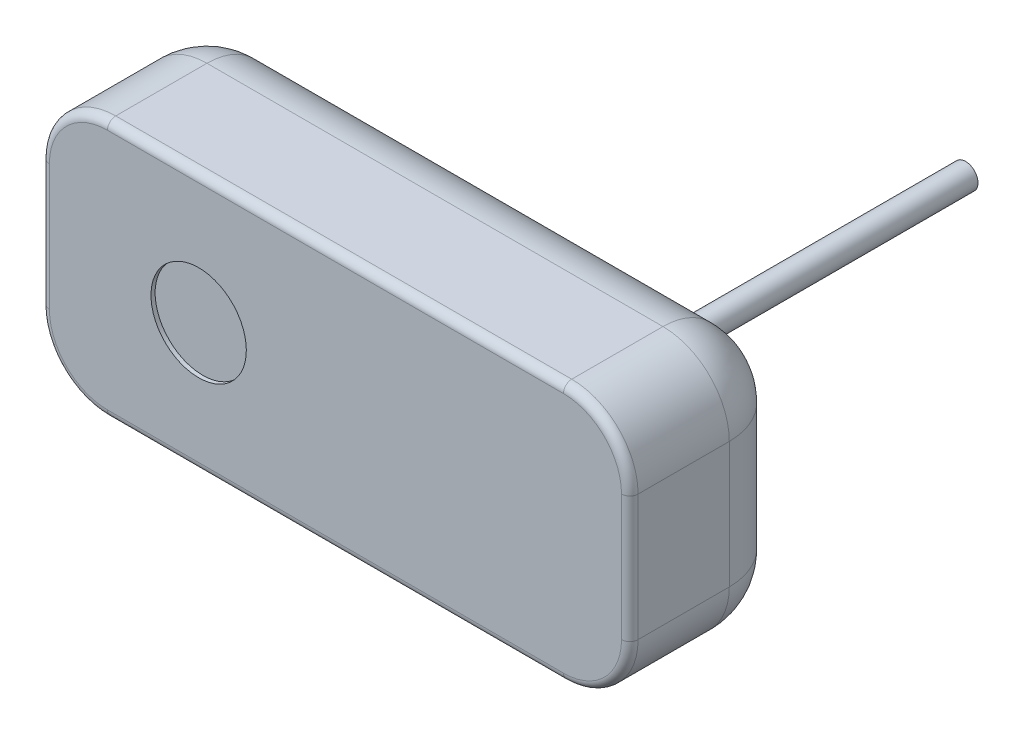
ISO-10303-21;
HEADER;
FILE_DESCRIPTION(('STEP AP214'),'2;1');
FILE_NAME('part.step','',(''),(''),'','','');
FILE_SCHEMA(('AUTOMOTIVE_DESIGN { 1 0 10303 214 1 1 1 1 }'));
ENDSEC;
DATA;
#1=APPLICATION_CONTEXT('core data for automotive mechanical design processes');
#2=APPLICATION_PROTOCOL_DEFINITION('international standard','automotive_design',2000,#1);
#3=PRODUCT_CONTEXT('',#1,'mechanical');
#4=PRODUCT('Part','Part','',(#3));
#5=PRODUCT_RELATED_PRODUCT_CATEGORY('part','',(#4));
#6=PRODUCT_DEFINITION_FORMATION('','',#4);
#7=PRODUCT_DEFINITION_CONTEXT('part definition',#1,'design');
#8=PRODUCT_DEFINITION('design','',#6,#7);
#9=PRODUCT_DEFINITION_SHAPE('','',#8);
#10=(LENGTH_UNIT() NAMED_UNIT(*) SI_UNIT(.MILLI.,.METRE.));
#11=(NAMED_UNIT(*) PLANE_ANGLE_UNIT() SI_UNIT($,.RADIAN.));
#12=(NAMED_UNIT(*) SI_UNIT($,.STERADIAN.) SOLID_ANGLE_UNIT());
#13=UNCERTAINTY_MEASURE_WITH_UNIT(LENGTH_MEASURE(1.E-05),#10,'distance_accuracy_value','');
#14=(GEOMETRIC_REPRESENTATION_CONTEXT(3) GLOBAL_UNCERTAINTY_ASSIGNED_CONTEXT((#13)) GLOBAL_UNIT_ASSIGNED_CONTEXT((#10,
#11,#12)) REPRESENTATION_CONTEXT('',''));
#15=CARTESIAN_POINT('',(0.,0.,0.));
#16=DIRECTION('',(0.,0.,1.));
#17=DIRECTION('',(1.,0.,0.));
#18=AXIS2_PLACEMENT_3D('',#15,#16,#17);
#19=CARTESIAN_POINT('',(-35.5,-15.6,20.));
#20=DIRECTION('',(-1.,0.,0.));
#21=DIRECTION('',(0.,0.,1.));
#22=AXIS2_PLACEMENT_3D('',#19,#20,#21);
#23=PLANE('',#22);
#24=DIRECTION('',(0.,0.,-1.));
#25=VECTOR('',#24,1.);
#26=CARTESIAN_POINT('',(-35.5,-7.6,20.));
#27=LINE('',#26,#25);
#28=CARTESIAN_POINT('',(-35.5,-7.6,8.));
#29=VERTEX_POINT('',#28);
#30=CARTESIAN_POINT('',(-35.5,-7.6,19.));
#31=VERTEX_POINT('',#30);
#32=EDGE_CURVE('E445',#29,#31,#27,.F.);
#33=ORIENTED_EDGE('',*,*,#32,.T.);
#34=DIRECTION('',(0.,1.,0.));
#35=VECTOR('',#34,1.);
#36=CARTESIAN_POINT('',(-35.5,7.6,19.));
#37=LINE('',#36,#35);
#38=CARTESIAN_POINT('',(-35.5,7.6,19.));
#39=VERTEX_POINT('',#38);
#40=EDGE_CURVE('E375',#31,#39,#37,.T.);
#41=ORIENTED_EDGE('',*,*,#40,.T.);
#42=DIRECTION('',(0.,0.,-1.));
#43=VECTOR('',#42,1.);
#44=CARTESIAN_POINT('',(-35.5,7.6,20.));
#45=LINE('',#44,#43);
#46=CARTESIAN_POINT('',(-35.5,7.6,8.));
#47=VERTEX_POINT('',#46);
#48=EDGE_CURVE('E448',#39,#47,#45,.T.);
#49=ORIENTED_EDGE('',*,*,#48,.T.);
#50=DIRECTION('',(0.,1.,0.));
#51=VECTOR('',#50,1.);
#52=CARTESIAN_POINT('',(-35.5,-15.6,8.));
#53=LINE('',#52,#51);
#54=EDGE_CURVE('E430',#47,#29,#53,.F.);
#55=ORIENTED_EDGE('',*,*,#54,.T.);
#56=EDGE_LOOP('',(#33,#41,#49,#55));
#57=FACE_BOUND('',#56,.T.);
#58=ADVANCED_FACE('F37',(#57),#23,.T.);
#59=CARTESIAN_POINT('',(-35.5,-15.6,20.));
#60=DIRECTION('',(0.,1.,0.));
#61=DIRECTION('',(0.,0.,1.));
#62=AXIS2_PLACEMENT_3D('',#59,#60,#61);
#63=PLANE('',#62);
#64=DIRECTION('',(0.,0.,-1.));
#65=VECTOR('',#64,1.);
#66=CARTESIAN_POINT('',(27.5,-15.6,20.));
#67=LINE('',#66,#65);
#68=CARTESIAN_POINT('',(27.5,-15.6,8.));
#69=VERTEX_POINT('',#68);
#70=CARTESIAN_POINT('',(27.5,-15.6,19.));
#71=VERTEX_POINT('',#70);
#72=EDGE_CURVE('E450',#69,#71,#67,.F.);
#73=ORIENTED_EDGE('',*,*,#72,.T.);
#74=DIRECTION('',(1.,0.,0.));
#75=VECTOR('',#74,1.);
#76=CARTESIAN_POINT('',(-35.5,-15.6,19.));
#77=LINE('',#76,#75);
#78=CARTESIAN_POINT('',(-27.5,-15.6,19.));
#79=VERTEX_POINT('',#78);
#80=EDGE_CURVE('E371',#71,#79,#77,.F.);
#81=ORIENTED_EDGE('',*,*,#80,.T.);
#82=DIRECTION('',(0.,0.,-1.));
#83=VECTOR('',#82,1.);
#84=CARTESIAN_POINT('',(-27.5,-15.6,0.));
#85=LINE('',#84,#83);
#86=CARTESIAN_POINT('',(-27.5,-15.6,8.));
#87=VERTEX_POINT('',#86);
#88=EDGE_CURVE('E453',#79,#87,#85,.T.);
#89=ORIENTED_EDGE('',*,*,#88,.T.);
#90=DIRECTION('',(1.,0.,0.));
#91=VECTOR('',#90,1.);
#92=CARTESIAN_POINT('',(27.5,-15.6,8.));
#93=LINE('',#92,#91);
#94=EDGE_CURVE('E425',#87,#69,#93,.T.);
#95=ORIENTED_EDGE('',*,*,#94,.T.);
#96=EDGE_LOOP('',(#73,#81,#89,#95));
#97=FACE_BOUND('',#96,.T.);
#98=ADVANCED_FACE('F244',(#97),#63,.F.);
#99=CARTESIAN_POINT('',(35.5,-15.6,20.));
#100=DIRECTION('',(-1.,0.,0.));
#101=DIRECTION('',(0.,0.,1.));
#102=AXIS2_PLACEMENT_3D('',#99,#100,#101);
#103=PLANE('',#102);
#104=DIRECTION('',(0.,0.,-1.));
#105=VECTOR('',#104,1.);
#106=CARTESIAN_POINT('',(35.5,7.6,20.));
#107=LINE('',#106,#105);
#108=CARTESIAN_POINT('',(35.5,7.6,8.));
#109=VERTEX_POINT('',#108);
#110=CARTESIAN_POINT('',(35.5,7.6,19.));
#111=VERTEX_POINT('',#110);
#112=EDGE_CURVE('E400',#109,#111,#107,.F.);
#113=ORIENTED_EDGE('',*,*,#112,.T.);
#114=DIRECTION('',(0.,1.,0.));
#115=VECTOR('',#114,1.);
#116=CARTESIAN_POINT('',(35.5,-15.6,19.));
#117=LINE('',#116,#115);
#118=CARTESIAN_POINT('',(35.5,-7.6,19.));
#119=VERTEX_POINT('',#118);
#120=EDGE_CURVE('E337',#111,#119,#117,.F.);
#121=ORIENTED_EDGE('',*,*,#120,.T.);
#122=DIRECTION('',(0.,0.,-1.));
#123=VECTOR('',#122,1.);
#124=CARTESIAN_POINT('',(35.5,-7.6,20.));
#125=LINE('',#124,#123);
#126=CARTESIAN_POINT('',(35.5,-7.6,8.));
#127=VERTEX_POINT('',#126);
#128=EDGE_CURVE('E455',#119,#127,#125,.T.);
#129=ORIENTED_EDGE('',*,*,#128,.T.);
#130=DIRECTION('',(0.,1.,0.));
#131=VECTOR('',#130,1.);
#132=CARTESIAN_POINT('',(35.5,7.6,8.));
#133=LINE('',#132,#131);
#134=EDGE_CURVE('E420',#127,#109,#133,.T.);
#135=ORIENTED_EDGE('',*,*,#134,.T.);
#136=EDGE_LOOP('',(#113,#121,#129,#135));
#137=FACE_BOUND('',#136,.T.);
#138=ADVANCED_FACE('F247',(#137),#103,.F.);
#139=CARTESIAN_POINT('',(-35.5,15.6,20.));
#140=DIRECTION('',(0.,1.,0.));
#141=DIRECTION('',(0.,0.,1.));
#142=AXIS2_PLACEMENT_3D('',#139,#140,#141);
#143=PLANE('',#142);
#144=DIRECTION('',(0.,0.,-1.));
#145=VECTOR('',#144,1.);
#146=CARTESIAN_POINT('',(-27.5,15.6,20.));
#147=LINE('',#146,#145);
#148=CARTESIAN_POINT('',(-27.5,15.6,8.));
#149=VERTEX_POINT('',#148);
#150=CARTESIAN_POINT('',(-27.5,15.6,19.));
#151=VERTEX_POINT('',#150);
#152=EDGE_CURVE('E442',#149,#151,#147,.F.);
#153=ORIENTED_EDGE('',*,*,#152,.T.);
#154=DIRECTION('',(1.,0.,0.));
#155=VECTOR('',#154,1.);
#156=CARTESIAN_POINT('',(27.5,15.6,19.));
#157=LINE('',#156,#155);
#158=CARTESIAN_POINT('',(27.5,15.6,19.));
#159=VERTEX_POINT('',#158);
#160=EDGE_CURVE('E11',#151,#159,#157,.T.);
#161=ORIENTED_EDGE('',*,*,#160,.T.);
#162=DIRECTION('',(0.,0.,-1.));
#163=VECTOR('',#162,1.);
#164=CARTESIAN_POINT('',(27.5,15.6,0.));
#165=LINE('',#164,#163);
#166=CARTESIAN_POINT('',(27.5,15.6,8.));
#167=VERTEX_POINT('',#166);
#168=EDGE_CURVE('E440',#159,#167,#165,.T.);
#169=ORIENTED_EDGE('',*,*,#168,.T.);
#170=DIRECTION('',(1.,0.,0.));
#171=VECTOR('',#170,1.);
#172=CARTESIAN_POINT('',(-35.5,15.6,8.));
#173=LINE('',#172,#171);
#174=EDGE_CURVE('E396',#167,#149,#173,.F.);
#175=ORIENTED_EDGE('',*,*,#174,.T.);
#176=EDGE_LOOP('',(#153,#161,#169,#175));
#177=FACE_BOUND('',#176,.T.);
#178=ADVANCED_FACE('F239',(#177),#143,.T.);
#179=CARTESIAN_POINT('',(0.,0.,20.));
#180=DIRECTION('',(0.,0.,-1.));
#181=DIRECTION('',(-1.,0.,0.));
#182=AXIS2_PLACEMENT_3D('',#179,#180,#181);
#183=PLANE('',#182);
#184=CARTESIAN_POINT('',(-16.5,0.,20.));
#185=DIRECTION('',(0.,0.,1.));
#186=DIRECTION('',(1.,0.,0.));
#187=AXIS2_PLACEMENT_3D('',#184,#185,#186);
#188=CIRCLE('',#187,5.75);
#189=CARTESIAN_POINT('',(-10.75,0.,20.));
#190=VERTEX_POINT('',#189);
#191=EDGE_CURVE('E459',#190,#190,#188,.T.);
#192=ORIENTED_EDGE('',*,*,#191,.F.);
#193=EDGE_LOOP('',(#192));
#194=FACE_BOUND('',#193,.T.);
#195=DIRECTION('',(1.,0.,0.));
#196=VECTOR('',#195,1.);
#197=CARTESIAN_POINT('',(-27.5,14.6,20.));
#198=LINE('',#197,#196);
#199=CARTESIAN_POINT('',(27.5,14.6,20.));
#200=VERTEX_POINT('',#199);
#201=CARTESIAN_POINT('',(-27.5,14.6,20.));
#202=VERTEX_POINT('',#201);
#203=EDGE_CURVE('E394',#200,#202,#198,.F.);
#204=ORIENTED_EDGE('',*,*,#203,.T.);
#205=CARTESIAN_POINT('',(-27.5,7.6,20.));
#206=DIRECTION('',(0.,0.,-1.));
#207=DIRECTION('',(-1.,0.,0.));
#208=AXIS2_PLACEMENT_3D('',#205,#206,#207);
#209=CIRCLE('',#208,7.);
#210=CARTESIAN_POINT('',(-34.5,7.6,20.));
#211=VERTEX_POINT('',#210);
#212=EDGE_CURVE('E380',#202,#211,#209,.F.);
#213=ORIENTED_EDGE('',*,*,#212,.T.);
#214=DIRECTION('',(0.,1.,0.));
#215=VECTOR('',#214,1.);
#216=CARTESIAN_POINT('',(-34.5,-7.6,20.));
#217=LINE('',#216,#215);
#218=CARTESIAN_POINT('',(-34.5,-7.6,20.));
#219=VERTEX_POINT('',#218);
#220=EDGE_CURVE('E383',#211,#219,#217,.F.);
#221=ORIENTED_EDGE('',*,*,#220,.T.);
#222=CARTESIAN_POINT('',(-27.5,-7.6,20.));
#223=DIRECTION('',(0.,0.,-1.));
#224=DIRECTION('',(-1.,0.,0.));
#225=AXIS2_PLACEMENT_3D('',#222,#223,#224);
#226=CIRCLE('',#225,7.);
#227=CARTESIAN_POINT('',(-27.5,-14.6,20.));
#228=VERTEX_POINT('',#227);
#229=EDGE_CURVE('E385',#219,#228,#226,.F.);
#230=ORIENTED_EDGE('',*,*,#229,.T.);
#231=DIRECTION('',(1.,0.,0.));
#232=VECTOR('',#231,1.);
#233=CARTESIAN_POINT('',(0.,-14.6,20.));
#234=LINE('',#233,#232);
#235=CARTESIAN_POINT('',(27.5,-14.6,20.));
#236=VERTEX_POINT('',#235);
#237=EDGE_CURVE('E387',#228,#236,#234,.T.);
#238=ORIENTED_EDGE('',*,*,#237,.T.);
#239=CARTESIAN_POINT('',(27.5,-7.6,20.));
#240=DIRECTION('',(0.,0.,-1.));
#241=DIRECTION('',(-1.,0.,0.));
#242=AXIS2_PLACEMENT_3D('',#239,#240,#241);
#243=CIRCLE('',#242,7.);
#244=CARTESIAN_POINT('',(34.5,-7.6,20.));
#245=VERTEX_POINT('',#244);
#246=EDGE_CURVE('E389',#236,#245,#243,.F.);
#247=ORIENTED_EDGE('',*,*,#246,.T.);
#248=DIRECTION('',(0.,1.,0.));
#249=VECTOR('',#248,1.);
#250=CARTESIAN_POINT('',(34.5,0.,20.));
#251=LINE('',#250,#249);
#252=CARTESIAN_POINT('',(34.5,7.6,20.));
#253=VERTEX_POINT('',#252);
#254=EDGE_CURVE('E339',#245,#253,#251,.T.);
#255=ORIENTED_EDGE('',*,*,#254,.T.);
#256=CARTESIAN_POINT('',(27.5,7.6,20.));
#257=DIRECTION('',(0.,0.,-1.));
#258=DIRECTION('',(-1.,0.,0.));
#259=AXIS2_PLACEMENT_3D('',#256,#257,#258);
#260=CIRCLE('',#259,7.);
#261=EDGE_CURVE('E392',#253,#200,#260,.F.);
#262=ORIENTED_EDGE('',*,*,#261,.T.);
#263=EDGE_LOOP('',(#204,#213,#221,#230,#238,#247,#255,#262));
#264=FACE_BOUND('',#263,.T.);
#265=ADVANCED_FACE('F236',(#194,#264),#183,.F.);
#266=CARTESIAN_POINT('',(0.,0.,0.));
#267=DIRECTION('',(0.,0.,-1.));
#268=DIRECTION('',(-1.,0.,0.));
#269=AXIS2_PLACEMENT_3D('',#266,#267,#268);
#270=PLANE('',#269);
#271=CARTESIAN_POINT('',(23.,8.6,0.));
#272=DIRECTION('',(0.,0.,-1.));
#273=DIRECTION('',(-1.,0.,0.));
#274=AXIS2_PLACEMENT_3D('',#271,#272,#273);
#275=CIRCLE('',#274,1.5);
#276=CARTESIAN_POINT('',(24.1180339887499,7.6,0.));
#277=VERTEX_POINT('',#276);
#278=CARTESIAN_POINT('',(21.8819660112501,7.6,0.));
#279=VERTEX_POINT('',#278);
#280=EDGE_CURVE('E180',#277,#279,#275,.T.);
#281=ORIENTED_EDGE('',*,*,#280,.F.);
#282=DIRECTION('',(1.,0.,0.));
#283=VECTOR('',#282,1.);
#284=CARTESIAN_POINT('',(0.,7.6,0.));
#285=LINE('',#284,#283);
#286=CARTESIAN_POINT('',(27.5,7.6,0.));
#287=VERTEX_POINT('',#286);
#288=EDGE_CURVE('E168',#277,#287,#285,.T.);
#289=ORIENTED_EDGE('',*,*,#288,.T.);
#290=DIRECTION('',(0.,1.,0.));
#291=VECTOR('',#290,1.);
#292=CARTESIAN_POINT('',(27.5,-7.6,0.));
#293=LINE('',#292,#291);
#294=CARTESIAN_POINT('',(27.5,-7.6,0.));
#295=VERTEX_POINT('',#294);
#296=EDGE_CURVE('E436',#287,#295,#293,.F.);
#297=ORIENTED_EDGE('',*,*,#296,.T.);
#298=DIRECTION('',(1.,0.,0.));
#299=VECTOR('',#298,1.);
#300=CARTESIAN_POINT('',(-27.5,-7.6,0.));
#301=LINE('',#300,#299);
#302=CARTESIAN_POINT('',(-27.5,-7.6,0.));
#303=VERTEX_POINT('',#302);
#304=EDGE_CURVE('E434',#295,#303,#301,.F.);
#305=ORIENTED_EDGE('',*,*,#304,.T.);
#306=DIRECTION('',(0.,1.,0.));
#307=VECTOR('',#306,1.);
#308=CARTESIAN_POINT('',(-27.5,0.,0.));
#309=LINE('',#308,#307);
#310=CARTESIAN_POINT('',(-27.5,7.6,0.));
#311=VERTEX_POINT('',#310);
#312=EDGE_CURVE('E432',#303,#311,#309,.T.);
#313=ORIENTED_EDGE('',*,*,#312,.T.);
#314=EDGE_CURVE('E176',#311,#279,#285,.T.);
#315=ORIENTED_EDGE('',*,*,#314,.T.);
#316=EDGE_LOOP('',(#281,#289,#297,#305,#313,#315));
#317=FACE_BOUND('',#316,.T.);
#318=DIRECTION('',(0.,-1.,0.));
#319=VECTOR('',#318,1.);
#320=CARTESIAN_POINT('',(-6.5,3.,0.));
#321=LINE('',#320,#319);
#322=CARTESIAN_POINT('',(-6.5,3.,0.));
#323=VERTEX_POINT('',#322);
#324=CARTESIAN_POINT('',(-6.5,-3.,0.));
#325=VERTEX_POINT('',#324);
#326=EDGE_CURVE('E202',#323,#325,#321,.T.);
#327=ORIENTED_EDGE('',*,*,#326,.F.);
#328=DIRECTION('',(-1.,0.,0.));
#329=VECTOR('',#328,1.);
#330=CARTESIAN_POINT('',(-6.5,3.,0.));
#331=LINE('',#330,#329);
#332=CARTESIAN_POINT('',(-13.5,3.,0.));
#333=VERTEX_POINT('',#332);
#334=EDGE_CURVE('E471',#323,#333,#331,.T.);
#335=ORIENTED_EDGE('',*,*,#334,.T.);
#336=DIRECTION('',(0.,-1.,0.));
#337=VECTOR('',#336,1.);
#338=CARTESIAN_POINT('',(-13.5,3.,0.));
#339=LINE('',#338,#337);
#340=CARTESIAN_POINT('',(-13.5,-3.,0.));
#341=VERTEX_POINT('',#340);
#342=EDGE_CURVE('E189',#333,#341,#339,.T.);
#343=ORIENTED_EDGE('',*,*,#342,.T.);
#344=DIRECTION('',(-1.,0.,0.));
#345=VECTOR('',#344,1.);
#346=CARTESIAN_POINT('',(-6.5,-3.,0.));
#347=LINE('',#346,#345);
#348=EDGE_CURVE('E62',#325,#341,#347,.T.);
#349=ORIENTED_EDGE('',*,*,#348,.F.);
#350=EDGE_LOOP('',(#327,#335,#343,#349));
#351=FACE_BOUND('',#350,.T.);
#352=ADVANCED_FACE('F181',(#317,#351),#270,.T.);
#353=CARTESIAN_POINT('',(27.5,-7.6,20.));
#354=DIRECTION('',(0.,0.,-1.));
#355=DIRECTION('',(-1.,0.,0.));
#356=AXIS2_PLACEMENT_3D('',#353,#354,#355);
#357=CYLINDRICAL_SURFACE('',#356,8.);
#358=ORIENTED_EDGE('',*,*,#128,.F.);
#359=CARTESIAN_POINT('',(27.5,-7.6,19.));
#360=DIRECTION('',(0.,0.,-1.));
#361=DIRECTION('',(-1.,0.,0.));
#362=AXIS2_PLACEMENT_3D('',#359,#360,#361);
#363=CIRCLE('',#362,8.);
#364=EDGE_CURVE('E369',#119,#71,#363,.T.);
#365=ORIENTED_EDGE('',*,*,#364,.T.);
#366=ORIENTED_EDGE('',*,*,#72,.F.);
#367=CARTESIAN_POINT('',(27.5,-7.6,8.));
#368=DIRECTION('',(0.,0.,-1.));
#369=DIRECTION('',(-1.,0.,0.));
#370=AXIS2_PLACEMENT_3D('',#367,#368,#369);
#371=CIRCLE('',#370,8.);
#372=EDGE_CURVE('E422',#69,#127,#371,.F.);
#373=ORIENTED_EDGE('',*,*,#372,.T.);
#374=EDGE_LOOP('',(#358,#365,#366,#373));
#375=FACE_BOUND('',#374,.T.);
#376=ADVANCED_FACE('F243',(#375),#357,.T.);
#377=CARTESIAN_POINT('',(-27.5,-7.6,20.));
#378=DIRECTION('',(0.,0.,1.));
#379=DIRECTION('',(1.,0.,0.));
#380=AXIS2_PLACEMENT_3D('',#377,#378,#379);
#381=CYLINDRICAL_SURFACE('',#380,8.);
#382=ORIENTED_EDGE('',*,*,#88,.F.);
#383=CARTESIAN_POINT('',(-27.5,-7.6,19.));
#384=DIRECTION('',(0.,0.,-1.));
#385=DIRECTION('',(-1.,0.,0.));
#386=AXIS2_PLACEMENT_3D('',#383,#384,#385);
#387=CIRCLE('',#386,8.);
#388=EDGE_CURVE('E373',#79,#31,#387,.T.);
#389=ORIENTED_EDGE('',*,*,#388,.T.);
#390=ORIENTED_EDGE('',*,*,#32,.F.);
#391=CARTESIAN_POINT('',(-27.5,-7.6,8.));
#392=DIRECTION('',(0.,0.,1.));
#393=DIRECTION('',(1.,0.,0.));
#394=AXIS2_PLACEMENT_3D('',#391,#392,#393);
#395=CIRCLE('',#394,8.);
#396=EDGE_CURVE('E427',#29,#87,#395,.T.);
#397=ORIENTED_EDGE('',*,*,#396,.T.);
#398=EDGE_LOOP('',(#382,#389,#390,#397));
#399=FACE_BOUND('',#398,.T.);
#400=ADVANCED_FACE('F260',(#399),#381,.T.);
#401=CARTESIAN_POINT('',(27.5,7.6,20.));
#402=DIRECTION('',(0.,0.,1.));
#403=DIRECTION('',(1.,0.,0.));
#404=AXIS2_PLACEMENT_3D('',#401,#402,#403);
#405=CYLINDRICAL_SURFACE('',#404,8.);
#406=ORIENTED_EDGE('',*,*,#168,.F.);
#407=CARTESIAN_POINT('',(27.5,7.6,19.));
#408=DIRECTION('',(0.,0.,-1.));
#409=DIRECTION('',(-1.,0.,0.));
#410=AXIS2_PLACEMENT_3D('',#407,#408,#409);
#411=CIRCLE('',#410,8.);
#412=EDGE_CURVE('E46',#159,#111,#411,.T.);
#413=ORIENTED_EDGE('',*,*,#412,.T.);
#414=ORIENTED_EDGE('',*,*,#112,.F.);
#415=CARTESIAN_POINT('',(27.5,7.6,8.));
#416=DIRECTION('',(0.,0.,1.));
#417=DIRECTION('',(1.,0.,0.));
#418=AXIS2_PLACEMENT_3D('',#415,#416,#417);
#419=CIRCLE('',#418,8.);
#420=EDGE_CURVE('E417',#109,#167,#419,.T.);
#421=ORIENTED_EDGE('',*,*,#420,.T.);
#422=EDGE_LOOP('',(#406,#413,#414,#421));
#423=FACE_BOUND('',#422,.T.);
#424=ADVANCED_FACE('F264',(#423),#405,.T.);
#425=CARTESIAN_POINT('',(-27.5,7.6,20.));
#426=DIRECTION('',(0.,0.,-1.));
#427=DIRECTION('',(-1.,0.,0.));
#428=AXIS2_PLACEMENT_3D('',#425,#426,#427);
#429=CYLINDRICAL_SURFACE('',#428,8.);
#430=ORIENTED_EDGE('',*,*,#48,.F.);
#431=CARTESIAN_POINT('',(-27.5,7.6,19.));
#432=DIRECTION('',(0.,0.,-1.));
#433=DIRECTION('',(-1.,0.,0.));
#434=AXIS2_PLACEMENT_3D('',#431,#432,#433);
#435=CIRCLE('',#434,8.);
#436=EDGE_CURVE('E377',#39,#151,#435,.T.);
#437=ORIENTED_EDGE('',*,*,#436,.T.);
#438=ORIENTED_EDGE('',*,*,#152,.F.);
#439=CARTESIAN_POINT('',(-27.5,7.6,8.));
#440=DIRECTION('',(0.,0.,-1.));
#441=DIRECTION('',(-1.,0.,0.));
#442=AXIS2_PLACEMENT_3D('',#439,#440,#441);
#443=CIRCLE('',#442,8.);
#444=EDGE_CURVE('E177',#149,#47,#443,.F.);
#445=ORIENTED_EDGE('',*,*,#444,.T.);
#446=EDGE_LOOP('',(#430,#437,#438,#445));
#447=FACE_BOUND('',#446,.T.);
#448=ADVANCED_FACE('F268',(#447),#429,.T.);
#449=CARTESIAN_POINT('',(27.5,-7.6,8.));
#450=DIRECTION('',(0.,0.,-1.));
#451=DIRECTION('',(-1.,0.,0.));
#452=AXIS2_PLACEMENT_3D('',#449,#450,#451);
#453=SPHERICAL_SURFACE('',#452,8.);
#454=CARTESIAN_POINT('',(27.5,-7.6,8.));
#455=DIRECTION('',(0.,1.,0.));
#456=DIRECTION('',(0.,0.,1.));
#457=AXIS2_PLACEMENT_3D('',#454,#455,#456);
#458=CIRCLE('',#457,8.);
#459=EDGE_CURVE('E401',#127,#295,#458,.T.);
#460=ORIENTED_EDGE('',*,*,#459,.F.);
#461=ORIENTED_EDGE('',*,*,#372,.F.);
#462=CARTESIAN_POINT('',(27.5,-7.6,8.));
#463=DIRECTION('',(-1.,0.,0.));
#464=DIRECTION('',(0.,-1.,0.));
#465=AXIS2_PLACEMENT_3D('',#462,#463,#464);
#466=CIRCLE('',#465,8.);
#467=EDGE_CURVE('E397',#295,#69,#466,.T.);
#468=ORIENTED_EDGE('',*,*,#467,.F.);
#469=EDGE_LOOP('',(#460,#461,#468));
#470=FACE_BOUND('',#469,.T.);
#471=ADVANCED_FACE('F272',(#470),#453,.T.);
#472=CARTESIAN_POINT('',(-35.5,-7.6,8.));
#473=DIRECTION('',(-1.,0.,0.));
#474=DIRECTION('',(0.,0.,1.));
#475=AXIS2_PLACEMENT_3D('',#472,#473,#474);
#476=CYLINDRICAL_SURFACE('',#475,8.);
#477=ORIENTED_EDGE('',*,*,#467,.T.);
#478=ORIENTED_EDGE('',*,*,#94,.F.);
#479=CARTESIAN_POINT('',(-27.5,-7.6,8.));
#480=DIRECTION('',(-1.,0.,0.));
#481=DIRECTION('',(0.,0.,1.));
#482=AXIS2_PLACEMENT_3D('',#479,#480,#481);
#483=CIRCLE('',#482,8.);
#484=EDGE_CURVE('E404',#303,#87,#483,.T.);
#485=ORIENTED_EDGE('',*,*,#484,.F.);
#486=ORIENTED_EDGE('',*,*,#304,.F.);
#487=EDGE_LOOP('',(#477,#478,#485,#486));
#488=FACE_BOUND('',#487,.T.);
#489=ADVANCED_FACE('F295',(#488),#476,.T.);
#490=CARTESIAN_POINT('',(27.5,-15.6,8.));
#491=DIRECTION('',(0.,-1.,0.));
#492=DIRECTION('',(0.,0.,-1.));
#493=AXIS2_PLACEMENT_3D('',#490,#491,#492);
#494=CYLINDRICAL_SURFACE('',#493,8.);
#495=ORIENTED_EDGE('',*,*,#459,.T.);
#496=ORIENTED_EDGE('',*,*,#296,.F.);
#497=CARTESIAN_POINT('',(27.5,7.6,8.));
#498=DIRECTION('',(0.,1.,0.));
#499=DIRECTION('',(0.,0.,1.));
#500=AXIS2_PLACEMENT_3D('',#497,#498,#499);
#501=CIRCLE('',#500,8.);
#502=EDGE_CURVE('E407',#109,#287,#501,.T.);
#503=ORIENTED_EDGE('',*,*,#502,.F.);
#504=ORIENTED_EDGE('',*,*,#134,.F.);
#505=EDGE_LOOP('',(#495,#496,#503,#504));
#506=FACE_BOUND('',#505,.T.);
#507=ADVANCED_FACE('F291',(#506),#494,.T.);
#508=CARTESIAN_POINT('',(-27.5,-7.6,8.));
#509=DIRECTION('',(0.,0.,-1.));
#510=DIRECTION('',(-1.,0.,0.));
#511=AXIS2_PLACEMENT_3D('',#508,#509,#510);
#512=SPHERICAL_SURFACE('',#511,8.);
#513=ORIENTED_EDGE('',*,*,#484,.T.);
#514=ORIENTED_EDGE('',*,*,#396,.F.);
#515=CARTESIAN_POINT('',(-27.5,-7.6,8.));
#516=DIRECTION('',(0.,1.,0.));
#517=DIRECTION('',(0.,0.,1.));
#518=AXIS2_PLACEMENT_3D('',#515,#516,#517);
#519=CIRCLE('',#518,8.);
#520=EDGE_CURVE('E410',#303,#29,#519,.T.);
#521=ORIENTED_EDGE('',*,*,#520,.F.);
#522=EDGE_LOOP('',(#513,#514,#521));
#523=FACE_BOUND('',#522,.T.);
#524=ADVANCED_FACE('F287',(#523),#512,.T.);
#525=CARTESIAN_POINT('',(27.5,7.6,8.));
#526=DIRECTION('',(0.,0.,-1.));
#527=DIRECTION('',(-1.,0.,0.));
#528=AXIS2_PLACEMENT_3D('',#525,#526,#527);
#529=SPHERICAL_SURFACE('',#528,8.);
#530=ORIENTED_EDGE('',*,*,#420,.F.);
#531=ORIENTED_EDGE('',*,*,#502,.T.);
#532=CARTESIAN_POINT('',(27.5,7.6,8.));
#533=DIRECTION('',(-1.,0.,0.));
#534=DIRECTION('',(0.,0.,1.));
#535=AXIS2_PLACEMENT_3D('',#532,#533,#534);
#536=CIRCLE('',#535,8.);
#537=EDGE_CURVE('E173',#167,#287,#536,.T.);
#538=ORIENTED_EDGE('',*,*,#537,.F.);
#539=EDGE_LOOP('',(#530,#531,#538));
#540=FACE_BOUND('',#539,.T.);
#541=ADVANCED_FACE('F283',(#540),#529,.T.);
#542=CARTESIAN_POINT('',(-27.5,0.,8.));
#543=DIRECTION('',(0.,1.,0.));
#544=DIRECTION('',(0.,0.,1.));
#545=AXIS2_PLACEMENT_3D('',#542,#543,#544);
#546=CYLINDRICAL_SURFACE('',#545,8.);
#547=ORIENTED_EDGE('',*,*,#520,.T.);
#548=ORIENTED_EDGE('',*,*,#54,.F.);
#549=CARTESIAN_POINT('',(-27.5,7.6,8.));
#550=DIRECTION('',(0.,1.,0.));
#551=DIRECTION('',(0.,0.,1.));
#552=AXIS2_PLACEMENT_3D('',#549,#550,#551);
#553=CIRCLE('',#552,8.);
#554=EDGE_CURVE('E344',#311,#47,#553,.T.);
#555=ORIENTED_EDGE('',*,*,#554,.F.);
#556=ORIENTED_EDGE('',*,*,#312,.F.);
#557=EDGE_LOOP('',(#547,#548,#555,#556));
#558=FACE_BOUND('',#557,.T.);
#559=ADVANCED_FACE('F280',(#558),#546,.T.);
#560=CARTESIAN_POINT('',(0.,7.6,8.));
#561=DIRECTION('',(1.,0.,0.));
#562=DIRECTION('',(0.,0.,-1.));
#563=AXIS2_PLACEMENT_3D('',#560,#561,#562);
#564=CYLINDRICAL_SURFACE('',#563,8.);
#565=CARTESIAN_POINT('',(24.1180339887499,7.6,0.));
#566=CARTESIAN_POINT('',(24.1458619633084,7.63111286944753,-1.76666099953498E-07));
#567=CARTESIAN_POINT('',(24.1723777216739,7.66337347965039,0.000181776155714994));
#568=CARTESIAN_POINT('',(24.2226280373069,7.72998670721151,0.000986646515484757));
#569=CARTESIAN_POINT('',(24.2463626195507,7.76433930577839,0.00160956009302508));
#570=CARTESIAN_POINT('',(24.3130860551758,7.87011325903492,0.00425186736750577));
#571=CARTESIAN_POINT('',(24.3516882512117,7.94435569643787,0.0070443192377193));
#572=CARTESIAN_POINT('',(24.4160055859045,8.0981164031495,0.0151510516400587));
#573=CARTESIAN_POINT('',(24.4417118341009,8.17763826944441,0.0204670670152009));
#574=CARTESIAN_POINT('',(24.4795629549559,8.33960730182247,0.0338481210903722));
#575=CARTESIAN_POINT('',(24.4917117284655,8.42205361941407,0.0419123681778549));
#576=CARTESIAN_POINT('',(24.5022295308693,8.58737947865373,0.0607308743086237));
#577=CARTESIAN_POINT('',(24.5006192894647,8.67025818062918,0.0714810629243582));
#578=CARTESIAN_POINT('',(24.4838810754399,8.83430309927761,0.0953576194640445));
#579=CARTESIAN_POINT('',(24.4687492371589,8.91546881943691,0.108484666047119));
#580=CARTESIAN_POINT('',(24.4251515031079,9.07531595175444,0.136785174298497));
#581=CARTESIAN_POINT('',(24.3964588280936,9.15392983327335,0.151990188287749));
#582=CARTESIAN_POINT('',(24.32654263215,9.30514246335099,0.183449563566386));
#583=CARTESIAN_POINT('',(24.2853178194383,9.37774059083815,0.199704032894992));
#584=CARTESIAN_POINT('',(24.1902029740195,9.51689844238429,0.232712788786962));
#585=CARTESIAN_POINT('',(24.1360109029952,9.58325152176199,0.249469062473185));
#586=CARTESIAN_POINT('',(24.0169716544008,9.70592681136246,0.281897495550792));
#587=CARTESIAN_POINT('',(23.9521234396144,9.76224804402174,0.297569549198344));
#588=CARTESIAN_POINT('',(23.8133289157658,9.8632782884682,0.326647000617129));
#589=CARTESIAN_POINT('',(23.739370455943,9.90797153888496,0.340049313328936));
#590=CARTESIAN_POINT('',(23.5844389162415,9.98415192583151,0.363415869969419));
#591=CARTESIAN_POINT('',(23.5034678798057,10.0156428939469,0.373381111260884));
#592=CARTESIAN_POINT('',(23.3400342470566,10.0633351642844,0.388654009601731));
#593=CARTESIAN_POINT('',(23.2577409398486,10.0800646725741,0.394122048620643));
#594=CARTESIAN_POINT('',(23.0913502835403,10.0995553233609,0.400504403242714));
#595=CARTESIAN_POINT('',(23.0072534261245,10.1023202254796,0.40141994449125));
#596=CARTESIAN_POINT('',(22.843103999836,10.0939470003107,0.398668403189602));
#597=CARTESIAN_POINT('',(22.7630206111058,10.0833413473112,0.395176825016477));
#598=CARTESIAN_POINT('',(22.6058525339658,10.0495205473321,0.384216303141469));
#599=CARTESIAN_POINT('',(22.5287679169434,10.0263051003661,0.37674726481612));
#600=CARTESIAN_POINT('',(22.3792317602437,9.96789165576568,0.358401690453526));
#601=CARTESIAN_POINT('',(22.3068082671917,9.93262795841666,0.34750649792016));
#602=CARTESIAN_POINT('',(22.1688281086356,9.85122876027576,0.323166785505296));
#603=CARTESIAN_POINT('',(22.1032728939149,9.80509096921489,0.309721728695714));
#604=CARTESIAN_POINT('',(21.9779327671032,9.7010398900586,0.280630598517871));
#605=CARTESIAN_POINT('',(21.9185080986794,9.64271184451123,0.264915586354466));
#606=CARTESIAN_POINT('',(21.8101620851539,9.51715061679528,0.232842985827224));
#607=CARTESIAN_POINT('',(21.761242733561,9.44991574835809,0.216485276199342));
#608=CARTESIAN_POINT('',(21.6737008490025,9.30587758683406,0.183632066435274));
#609=CARTESIAN_POINT('',(21.6354714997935,9.22883171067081,0.167149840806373));
#610=CARTESIAN_POINT('',(21.5726501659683,9.0690823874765,0.1356233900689));
#611=CARTESIAN_POINT('',(21.5480584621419,8.98637882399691,0.120579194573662));
#612=CARTESIAN_POINT('',(21.5134637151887,8.81806167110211,0.092816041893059));
#613=CARTESIAN_POINT('',(21.5033832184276,8.73246604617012,0.0800850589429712));
#614=CARTESIAN_POINT('',(21.4980561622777,8.56045442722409,0.0573904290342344));
#615=CARTESIAN_POINT('',(21.50280620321,8.47403862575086,0.0474261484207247));
#616=CARTESIAN_POINT('',(21.5268319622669,8.30530042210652,0.0307117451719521));
#617=CARTESIAN_POINT('',(21.5457195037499,8.22293022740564,0.0238834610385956));
#618=CARTESIAN_POINT('',(21.5971285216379,8.06236621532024,0.0129673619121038));
#619=CARTESIAN_POINT('',(21.6296462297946,7.98417125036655,0.00887879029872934));
#620=CARTESIAN_POINT('',(21.6974284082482,7.8535028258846,0.00382213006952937));
#621=CARTESIAN_POINT('',(21.7298683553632,7.79956208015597,0.00232366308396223));
#622=CARTESIAN_POINT('',(21.8012059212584,7.69620620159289,0.000410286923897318));
#623=CARTESIAN_POINT('',(21.840096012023,7.64678589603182,-5.87608095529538E-06));
#624=CARTESIAN_POINT('',(21.8819660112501,7.6,0.));
#625=B_SPLINE_CURVE_WITH_KNOTS('',3,(#565,#566,#567,#568,#569,#570,#571,#572,#573,#574,#575,
#576,#577,#578,#579,#580,#581,#582,#583,#584,#585,#586,#587,#588,#589,#590,#591,#592,#593,#594,
#595,#596,#597,#598,#599,#600,#601,#602,#603,#604,#605,#606,#607,#608,#609,#610,#611,#612,#613,
#614,#615,#616,#617,#618,#619,#620,#621,#622,#623,#624),.UNSPECIFIED.,.F.,.F.,(4,2,2,2,2,2,2,2,
2,2,2,2,2,2,2,2,2,2,2,2,2,2,2,2,2,2,2,2,2,4),(0.,0.125150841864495,0.250300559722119,
0.500183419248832,0.75023831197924,1.0002212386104,1.24982760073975,1.49950534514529,
1.7535147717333,2.00755038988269,2.26820567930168,2.52888635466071,2.7899185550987,
3.05087494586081,3.30206307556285,3.55318357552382,3.79461198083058,4.03604612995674,
4.27881841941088,4.52164188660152,4.77471236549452,5.02783082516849,5.28930435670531,
5.55078327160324,5.81086129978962,6.07087971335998,6.32400921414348,6.57706877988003,
6.76547213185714,6.95365712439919),.UNSPECIFIED.);
#626=EDGE_CURVE('E54',#277,#279,#625,.T.);
#627=ORIENTED_EDGE('',*,*,#626,.T.);
#628=ORIENTED_EDGE('',*,*,#314,.F.);
#629=CARTESIAN_POINT('',(-27.5,7.6,8.));
#630=DIRECTION('',(-1.,0.,0.));
#631=DIRECTION('',(0.,0.,1.));
#632=AXIS2_PLACEMENT_3D('',#629,#630,#631);
#633=CIRCLE('',#632,8.);
#634=EDGE_CURVE('E342',#149,#311,#633,.T.);
#635=ORIENTED_EDGE('',*,*,#634,.F.);
#636=ORIENTED_EDGE('',*,*,#174,.F.);
#637=ORIENTED_EDGE('',*,*,#537,.T.);
#638=ORIENTED_EDGE('',*,*,#288,.F.);
#639=EDGE_LOOP('',(#627,#628,#635,#636,#637,#638));
#640=FACE_BOUND('',#639,.T.);
#641=ADVANCED_FACE('F170',(#640),#564,.T.);
#642=CARTESIAN_POINT('',(-27.5,7.6,8.));
#643=DIRECTION('',(0.,0.,-1.));
#644=DIRECTION('',(-1.,0.,0.));
#645=AXIS2_PLACEMENT_3D('',#642,#643,#644);
#646=SPHERICAL_SURFACE('',#645,8.);
#647=ORIENTED_EDGE('',*,*,#554,.T.);
#648=ORIENTED_EDGE('',*,*,#444,.F.);
#649=ORIENTED_EDGE('',*,*,#634,.T.);
#650=EDGE_LOOP('',(#647,#648,#649));
#651=FACE_BOUND('',#650,.T.);
#652=ADVANCED_FACE('F274',(#651),#646,.T.);
#653=CARTESIAN_POINT('',(27.5,-7.6,19.));
#654=DIRECTION('',(0.,0.,-1.));
#655=DIRECTION('',(-1.,0.,0.));
#656=AXIS2_PLACEMENT_3D('',#653,#654,#655);
#657=TOROIDAL_SURFACE('',#656,7.,1.);
#658=CARTESIAN_POINT('',(27.5,-14.6,19.));
#659=DIRECTION('',(-1.,0.,0.));
#660=DIRECTION('',(0.,0.,1.));
#661=AXIS2_PLACEMENT_3D('',#658,#659,#660);
#662=CIRCLE('',#661,1.);
#663=EDGE_CURVE('E343',#71,#236,#662,.T.);
#664=ORIENTED_EDGE('',*,*,#663,.F.);
#665=ORIENTED_EDGE('',*,*,#364,.F.);
#666=CARTESIAN_POINT('',(34.5,-7.6,19.));
#667=DIRECTION('',(0.,1.,0.));
#668=DIRECTION('',(0.,0.,1.));
#669=AXIS2_PLACEMENT_3D('',#666,#667,#668);
#670=CIRCLE('',#669,1.);
#671=EDGE_CURVE('E41',#245,#119,#670,.T.);
#672=ORIENTED_EDGE('',*,*,#671,.F.);
#673=ORIENTED_EDGE('',*,*,#246,.F.);
#674=EDGE_LOOP('',(#664,#665,#672,#673));
#675=FACE_BOUND('',#674,.T.);
#676=ADVANCED_FACE('F39',(#675),#657,.T.);
#677=CARTESIAN_POINT('',(34.5,0.,19.));
#678=DIRECTION('',(0.,1.,0.));
#679=DIRECTION('',(0.,0.,1.));
#680=AXIS2_PLACEMENT_3D('',#677,#678,#679);
#681=CYLINDRICAL_SURFACE('',#680,1.);
#682=ORIENTED_EDGE('',*,*,#671,.T.);
#683=ORIENTED_EDGE('',*,*,#120,.F.);
#684=CARTESIAN_POINT('',(34.5,7.6,19.));
#685=DIRECTION('',(0.,1.,0.));
#686=DIRECTION('',(0.,0.,1.));
#687=AXIS2_PLACEMENT_3D('',#684,#685,#686);
#688=CIRCLE('',#687,1.);
#689=EDGE_CURVE('E347',#253,#111,#688,.T.);
#690=ORIENTED_EDGE('',*,*,#689,.F.);
#691=ORIENTED_EDGE('',*,*,#254,.F.);
#692=EDGE_LOOP('',(#682,#683,#690,#691));
#693=FACE_BOUND('',#692,.T.);
#694=ADVANCED_FACE('F324',(#693),#681,.T.);
#695=CARTESIAN_POINT('',(0.,-14.6,19.));
#696=DIRECTION('',(1.,0.,0.));
#697=DIRECTION('',(0.,0.,-1.));
#698=AXIS2_PLACEMENT_3D('',#695,#696,#697);
#699=CYLINDRICAL_SURFACE('',#698,1.);
#700=ORIENTED_EDGE('',*,*,#663,.T.);
#701=ORIENTED_EDGE('',*,*,#237,.F.);
#702=CARTESIAN_POINT('',(-27.5,-14.6,19.));
#703=DIRECTION('',(-1.,0.,0.));
#704=DIRECTION('',(0.,0.,1.));
#705=AXIS2_PLACEMENT_3D('',#702,#703,#704);
#706=CIRCLE('',#705,1.);
#707=EDGE_CURVE('E351',#79,#228,#706,.T.);
#708=ORIENTED_EDGE('',*,*,#707,.F.);
#709=ORIENTED_EDGE('',*,*,#80,.F.);
#710=EDGE_LOOP('',(#700,#701,#708,#709));
#711=FACE_BOUND('',#710,.T.);
#712=ADVANCED_FACE('F321',(#711),#699,.T.);
#713=CARTESIAN_POINT('',(27.5,7.6,19.));
#714=DIRECTION('',(0.,0.,-1.));
#715=DIRECTION('',(-1.,0.,0.));
#716=AXIS2_PLACEMENT_3D('',#713,#714,#715);
#717=TOROIDAL_SURFACE('',#716,7.,1.);
#718=ORIENTED_EDGE('',*,*,#689,.T.);
#719=ORIENTED_EDGE('',*,*,#412,.F.);
#720=CARTESIAN_POINT('',(27.5,14.6,19.));
#721=DIRECTION('',(-1.,0.,0.));
#722=DIRECTION('',(0.,0.,1.));
#723=AXIS2_PLACEMENT_3D('',#720,#721,#722);
#724=CIRCLE('',#723,1.);
#725=EDGE_CURVE('E356',#200,#159,#724,.T.);
#726=ORIENTED_EDGE('',*,*,#725,.F.);
#727=ORIENTED_EDGE('',*,*,#261,.F.);
#728=EDGE_LOOP('',(#718,#719,#726,#727));
#729=FACE_BOUND('',#728,.T.);
#730=ADVANCED_FACE('F317',(#729),#717,.T.);
#731=CARTESIAN_POINT('',(-27.5,-7.6,19.));
#732=DIRECTION('',(0.,0.,-1.));
#733=DIRECTION('',(-1.,0.,0.));
#734=AXIS2_PLACEMENT_3D('',#731,#732,#733);
#735=TOROIDAL_SURFACE('',#734,7.,1.);
#736=ORIENTED_EDGE('',*,*,#707,.T.);
#737=ORIENTED_EDGE('',*,*,#229,.F.);
#738=CARTESIAN_POINT('',(-34.5,-7.6,19.));
#739=DIRECTION('',(0.,1.,0.));
#740=DIRECTION('',(0.,0.,1.));
#741=AXIS2_PLACEMENT_3D('',#738,#739,#740);
#742=CIRCLE('',#741,1.);
#743=EDGE_CURVE('E359',#31,#219,#742,.T.);
#744=ORIENTED_EDGE('',*,*,#743,.F.);
#745=ORIENTED_EDGE('',*,*,#388,.F.);
#746=EDGE_LOOP('',(#736,#737,#744,#745));
#747=FACE_BOUND('',#746,.T.);
#748=ADVANCED_FACE('F313',(#747),#735,.T.);
#749=CARTESIAN_POINT('',(-35.5,14.6,19.));
#750=DIRECTION('',(-1.,0.,0.));
#751=DIRECTION('',(0.,0.,1.));
#752=AXIS2_PLACEMENT_3D('',#749,#750,#751);
#753=CYLINDRICAL_SURFACE('',#752,1.);
#754=ORIENTED_EDGE('',*,*,#725,.T.);
#755=ORIENTED_EDGE('',*,*,#160,.F.);
#756=CARTESIAN_POINT('',(-27.5,14.6,19.));
#757=DIRECTION('',(-1.,0.,0.));
#758=DIRECTION('',(0.,0.,1.));
#759=AXIS2_PLACEMENT_3D('',#756,#757,#758);
#760=CIRCLE('',#759,1.);
#761=EDGE_CURVE('E362',#202,#151,#760,.T.);
#762=ORIENTED_EDGE('',*,*,#761,.F.);
#763=ORIENTED_EDGE('',*,*,#203,.F.);
#764=EDGE_LOOP('',(#754,#755,#762,#763));
#765=FACE_BOUND('',#764,.T.);
#766=ADVANCED_FACE('F309',(#765),#753,.T.);
#767=CARTESIAN_POINT('',(-34.5,-15.6,19.));
#768=DIRECTION('',(0.,-1.,0.));
#769=DIRECTION('',(0.,0.,-1.));
#770=AXIS2_PLACEMENT_3D('',#767,#768,#769);
#771=CYLINDRICAL_SURFACE('',#770,1.);
#772=ORIENTED_EDGE('',*,*,#743,.T.);
#773=ORIENTED_EDGE('',*,*,#220,.F.);
#774=CARTESIAN_POINT('',(-34.5,7.6,19.));
#775=DIRECTION('',(0.,1.,0.));
#776=DIRECTION('',(0.,0.,1.));
#777=AXIS2_PLACEMENT_3D('',#774,#775,#776);
#778=CIRCLE('',#777,1.);
#779=EDGE_CURVE('E364',#39,#211,#778,.T.);
#780=ORIENTED_EDGE('',*,*,#779,.F.);
#781=ORIENTED_EDGE('',*,*,#40,.F.);
#782=EDGE_LOOP('',(#772,#773,#780,#781));
#783=FACE_BOUND('',#782,.T.);
#784=ADVANCED_FACE('F305',(#783),#771,.T.);
#785=CARTESIAN_POINT('',(-27.5,7.6,19.));
#786=DIRECTION('',(0.,0.,-1.));
#787=DIRECTION('',(-1.,0.,0.));
#788=AXIS2_PLACEMENT_3D('',#785,#786,#787);
#789=TOROIDAL_SURFACE('',#788,7.,1.);
#790=ORIENTED_EDGE('',*,*,#761,.T.);
#791=ORIENTED_EDGE('',*,*,#436,.F.);
#792=ORIENTED_EDGE('',*,*,#779,.T.);
#793=ORIENTED_EDGE('',*,*,#212,.F.);
#794=EDGE_LOOP('',(#790,#791,#792,#793));
#795=FACE_BOUND('',#794,.T.);
#796=ADVANCED_FACE('F234',(#795),#789,.T.);
#797=CARTESIAN_POINT('',(-16.5,0.,19.5));
#798=DIRECTION('',(0.,0.,1.));
#799=DIRECTION('',(1.,0.,0.));
#800=AXIS2_PLACEMENT_3D('',#797,#798,#799);
#801=CYLINDRICAL_SURFACE('',#800,5.75);
#802=CARTESIAN_POINT('',(-16.5,0.,19.5));
#803=DIRECTION('',(0.,0.,1.));
#804=DIRECTION('',(1.,0.,0.));
#805=AXIS2_PLACEMENT_3D('',#802,#803,#804);
#806=CIRCLE('',#805,5.75);
#807=CARTESIAN_POINT('',(-10.75,0.,19.5));
#808=VERTEX_POINT('',#807);
#809=EDGE_CURVE('E365',#808,#808,#806,.T.);
#810=ORIENTED_EDGE('',*,*,#809,.F.);
#811=EDGE_LOOP('',(#810));
#812=FACE_BOUND('',#811,.T.);
#813=ORIENTED_EDGE('',*,*,#191,.T.);
#814=EDGE_LOOP('',(#813));
#815=FACE_BOUND('',#814,.T.);
#816=ADVANCED_FACE('F230',(#812,#815),#801,.F.);
#817=CARTESIAN_POINT('',(-16.5,0.,19.5));
#818=DIRECTION('',(0.,0.,1.));
#819=DIRECTION('',(1.,0.,0.));
#820=AXIS2_PLACEMENT_3D('',#817,#818,#819);
#821=PLANE('',#820);
#822=ORIENTED_EDGE('',*,*,#809,.T.);
#823=EDGE_LOOP('',(#822));
#824=FACE_BOUND('',#823,.T.);
#825=ADVANCED_FACE('F227',(#824),#821,.T.);
#826=CARTESIAN_POINT('',(-6.5,-3.,0.));
#827=DIRECTION('',(0.,1.,0.));
#828=DIRECTION('',(0.,0.,1.));
#829=AXIS2_PLACEMENT_3D('',#826,#827,#828);
#830=PLANE('',#829);
#831=DIRECTION('',(0.,0.,-1.));
#832=VECTOR('',#831,1.);
#833=CARTESIAN_POINT('',(-13.5,-3.,0.));
#834=LINE('',#833,#832);
#835=CARTESIAN_POINT('',(-13.5,-3.,-3.5));
#836=VERTEX_POINT('',#835);
#837=EDGE_CURVE('E192',#341,#836,#834,.T.);
#838=ORIENTED_EDGE('',*,*,#837,.T.);
#839=DIRECTION('',(-1.,0.,0.));
#840=VECTOR('',#839,1.);
#841=CARTESIAN_POINT('',(-6.5,-3.,-3.5));
#842=LINE('',#841,#840);
#843=CARTESIAN_POINT('',(-6.5,-3.,-3.5));
#844=VERTEX_POINT('',#843);
#845=EDGE_CURVE('E465',#844,#836,#842,.T.);
#846=ORIENTED_EDGE('',*,*,#845,.F.);
#847=DIRECTION('',(0.,0.,-1.));
#848=VECTOR('',#847,1.);
#849=CARTESIAN_POINT('',(-6.5,-3.,0.));
#850=LINE('',#849,#848);
#851=EDGE_CURVE('E482',#325,#844,#850,.T.);
#852=ORIENTED_EDGE('',*,*,#851,.F.);
#853=ORIENTED_EDGE('',*,*,#348,.T.);
#854=EDGE_LOOP('',(#838,#846,#852,#853));
#855=FACE_BOUND('',#854,.T.);
#856=ADVANCED_FACE('F223',(#855),#830,.F.);
#857=CARTESIAN_POINT('',(-6.5,0.,-3.5));
#858=DIRECTION('',(-1.,0.,0.));
#859=DIRECTION('',(0.,0.,1.));
#860=AXIS2_PLACEMENT_3D('',#857,#858,#859);
#861=CYLINDRICAL_SURFACE('',#860,3.);
#862=CARTESIAN_POINT('',(-13.5,0.,-3.5));
#863=DIRECTION('',(1.,0.,0.));
#864=DIRECTION('',(0.,0.,-1.));
#865=AXIS2_PLACEMENT_3D('',#862,#863,#864);
#866=CIRCLE('',#865,3.);
#867=CARTESIAN_POINT('',(-13.5,3.,-3.5));
#868=VERTEX_POINT('',#867);
#869=EDGE_CURVE('E477',#836,#868,#866,.T.);
#870=ORIENTED_EDGE('',*,*,#869,.T.);
#871=DIRECTION('',(-1.,0.,0.));
#872=VECTOR('',#871,1.);
#873=CARTESIAN_POINT('',(-6.5,3.,-3.5));
#874=LINE('',#873,#872);
#875=CARTESIAN_POINT('',(-6.5,3.,-3.5));
#876=VERTEX_POINT('',#875);
#877=EDGE_CURVE('E468',#876,#868,#874,.T.);
#878=ORIENTED_EDGE('',*,*,#877,.F.);
#879=CARTESIAN_POINT('',(-6.5,0.,-3.5));
#880=DIRECTION('',(1.,0.,0.));
#881=DIRECTION('',(0.,0.,-1.));
#882=AXIS2_PLACEMENT_3D('',#879,#880,#881);
#883=CIRCLE('',#882,3.);
#884=EDGE_CURVE('E481',#844,#876,#883,.T.);
#885=ORIENTED_EDGE('',*,*,#884,.F.);
#886=ORIENTED_EDGE('',*,*,#845,.T.);
#887=EDGE_LOOP('',(#870,#878,#885,#886));
#888=FACE_BOUND('',#887,.T.);
#889=ADVANCED_FACE('F219',(#888),#861,.T.);
#890=CARTESIAN_POINT('',(-6.5,3.,0.));
#891=DIRECTION('',(0.,-1.,0.));
#892=DIRECTION('',(0.,0.,-1.));
#893=AXIS2_PLACEMENT_3D('',#890,#891,#892);
#894=PLANE('',#893);
#895=DIRECTION('',(0.,0.,1.));
#896=VECTOR('',#895,1.);
#897=CARTESIAN_POINT('',(-13.5,3.,0.));
#898=LINE('',#897,#896);
#899=EDGE_CURVE('E475',#868,#333,#898,.T.);
#900=ORIENTED_EDGE('',*,*,#899,.T.);
#901=ORIENTED_EDGE('',*,*,#334,.F.);
#902=DIRECTION('',(0.,0.,1.));
#903=VECTOR('',#902,1.);
#904=CARTESIAN_POINT('',(-6.5,3.,0.));
#905=LINE('',#904,#903);
#906=EDGE_CURVE('E474',#876,#323,#905,.T.);
#907=ORIENTED_EDGE('',*,*,#906,.F.);
#908=ORIENTED_EDGE('',*,*,#877,.T.);
#909=EDGE_LOOP('',(#900,#901,#907,#908));
#910=FACE_BOUND('',#909,.T.);
#911=ADVANCED_FACE('F212',(#910),#894,.F.);
#912=CARTESIAN_POINT('',(-6.5,0.,-3.5));
#913=DIRECTION('',(1.,0.,0.));
#914=DIRECTION('',(0.,0.,-1.));
#915=AXIS2_PLACEMENT_3D('',#912,#913,#914);
#916=PLANE('',#915);
#917=ORIENTED_EDGE('',*,*,#326,.T.);
#918=ORIENTED_EDGE('',*,*,#851,.T.);
#919=ORIENTED_EDGE('',*,*,#884,.T.);
#920=ORIENTED_EDGE('',*,*,#906,.T.);
#921=EDGE_LOOP('',(#917,#918,#919,#920));
#922=FACE_BOUND('',#921,.T.);
#923=ADVANCED_FACE('F208',(#922),#916,.T.);
#924=CARTESIAN_POINT('',(-13.5,0.,-3.5));
#925=DIRECTION('',(1.,0.,0.));
#926=DIRECTION('',(0.,0.,-1.));
#927=AXIS2_PLACEMENT_3D('',#924,#925,#926);
#928=PLANE('',#927);
#929=ORIENTED_EDGE('',*,*,#342,.F.);
#930=ORIENTED_EDGE('',*,*,#899,.F.);
#931=ORIENTED_EDGE('',*,*,#869,.F.);
#932=ORIENTED_EDGE('',*,*,#837,.F.);
#933=EDGE_LOOP('',(#929,#930,#931,#932));
#934=FACE_BOUND('',#933,.T.);
#935=ADVANCED_FACE('F211',(#934),#928,.F.);
#936=CARTESIAN_POINT('',(23.,8.6,500000.));
#937=DIRECTION('',(0.,0.,-1.));
#938=DIRECTION('',(-1.,0.,0.));
#939=AXIS2_PLACEMENT_3D('',#936,#937,#938);
#940=CYLINDRICAL_SURFACE('',#939,1.5);
#941=ORIENTED_EDGE('',*,*,#626,.F.);
#942=ORIENTED_EDGE('',*,*,#280,.T.);
#943=EDGE_LOOP('',(#941,#942));
#944=FACE_BOUND('',#943,.T.);
#945=CARTESIAN_POINT('',(23.,8.6,-33.));
#946=DIRECTION('',(0.,0.,-1.));
#947=DIRECTION('',(-1.,0.,0.));
#948=AXIS2_PLACEMENT_3D('',#945,#946,#947);
#949=CIRCLE('',#948,1.5);
#950=CARTESIAN_POINT('',(21.5,8.6,-33.));
#951=VERTEX_POINT('',#950);
#952=EDGE_CURVE('E185',#951,#951,#949,.T.);
#953=ORIENTED_EDGE('',*,*,#952,.F.);
#954=EDGE_LOOP('',(#953));
#955=FACE_BOUND('',#954,.T.);
#956=ADVANCED_FACE('F187',(#944,#955),#940,.T.);
#957=CARTESIAN_POINT('',(23.,8.6,-33.));
#958=DIRECTION('',(0.,0.,-1.));
#959=DIRECTION('',(-1.,0.,0.));
#960=AXIS2_PLACEMENT_3D('',#957,#958,#959);
#961=PLANE('',#960);
#962=ORIENTED_EDGE('',*,*,#952,.T.);
#963=EDGE_LOOP('',(#962));
#964=FACE_BOUND('',#963,.T.);
#965=ADVANCED_FACE('F733',(#964),#961,.T.);
#966=CLOSED_SHELL('',(#58,#98,#138,#178,#265,#352,#376,#400,#424,#448,#471,#489,#507,#524,#541,
#559,#641,#652,#676,#694,#712,#730,#748,#766,#784,#796,#816,#825,#856,#889,#911,#923,#935,#956,#965));
#967=MANIFOLD_SOLID_BREP('B2',#966);
#968=ADVANCED_BREP_SHAPE_REPRESENTATION('',(#18,#967),#14);
#969=SHAPE_DEFINITION_REPRESENTATION(#9,#968);
ENDSEC;
END-ISO-10303-21;
